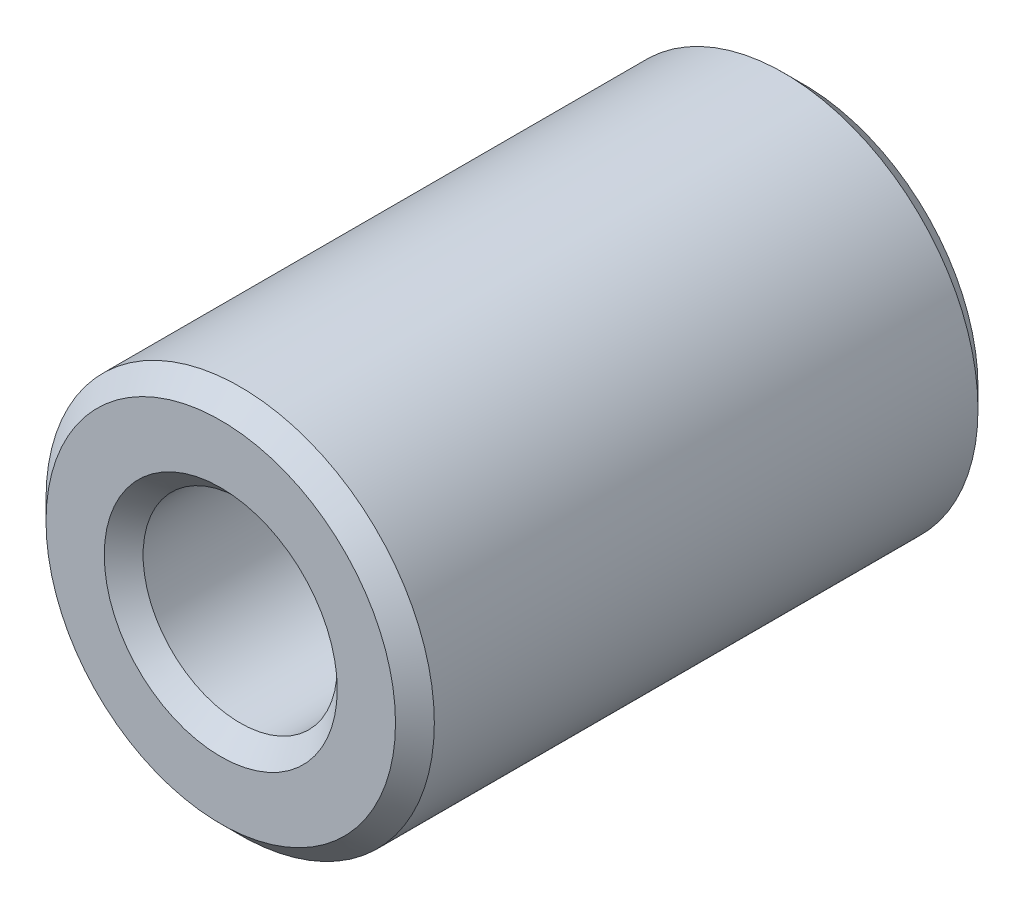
ISO-10303-21;
HEADER;
FILE_DESCRIPTION(('STEP AP214'),'2;1');
FILE_NAME('part.step','',(''),(''),'','','');
FILE_SCHEMA(('AUTOMOTIVE_DESIGN { 1 0 10303 214 1 1 1 1 }'));
ENDSEC;
DATA;
#1=APPLICATION_CONTEXT('core data for automotive mechanical design processes');
#2=APPLICATION_PROTOCOL_DEFINITION('international standard','automotive_design',2000,#1);
#3=PRODUCT_CONTEXT('',#1,'mechanical');
#4=PRODUCT('Part','Part','',(#3));
#5=PRODUCT_RELATED_PRODUCT_CATEGORY('part','',(#4));
#6=PRODUCT_DEFINITION_FORMATION('','',#4);
#7=PRODUCT_DEFINITION_CONTEXT('part definition',#1,'design');
#8=PRODUCT_DEFINITION('design','',#6,#7);
#9=PRODUCT_DEFINITION_SHAPE('','',#8);
#10=(LENGTH_UNIT() NAMED_UNIT(*) SI_UNIT(.MILLI.,.METRE.));
#11=(NAMED_UNIT(*) PLANE_ANGLE_UNIT() SI_UNIT($,.RADIAN.));
#12=(NAMED_UNIT(*) SI_UNIT($,.STERADIAN.) SOLID_ANGLE_UNIT());
#13=UNCERTAINTY_MEASURE_WITH_UNIT(LENGTH_MEASURE(1.E-05),#10,'distance_accuracy_value','');
#14=(GEOMETRIC_REPRESENTATION_CONTEXT(3) GLOBAL_UNCERTAINTY_ASSIGNED_CONTEXT((#13)) GLOBAL_UNIT_ASSIGNED_CONTEXT((#10,
#11,#12)) REPRESENTATION_CONTEXT('',''));
#15=CARTESIAN_POINT('',(0.,0.,0.));
#16=DIRECTION('',(0.,0.,1.));
#17=DIRECTION('',(1.,0.,0.));
#18=AXIS2_PLACEMENT_3D('',#15,#16,#17);
#19=CARTESIAN_POINT('',(0.,0.,-15.));
#20=DIRECTION('',(0.,0.,1.));
#21=DIRECTION('',(1.,0.,0.));
#22=AXIS2_PLACEMENT_3D('',#19,#20,#21);
#23=CYLINDRICAL_SURFACE('',#22,5.);
#24=CARTESIAN_POINT('',(0.,0.,-0.5));
#25=DIRECTION('',(0.,0.,1.));
#26=DIRECTION('',(1.,0.,0.));
#27=AXIS2_PLACEMENT_3D('',#24,#25,#26);
#28=CIRCLE('',#27,5.);
#29=CARTESIAN_POINT('',(5.,0.,-0.5));
#30=VERTEX_POINT('',#29);
#31=EDGE_CURVE('E49',#30,#30,#28,.F.);
#32=ORIENTED_EDGE('',*,*,#31,.T.);
#33=EDGE_LOOP('',(#32));
#34=FACE_BOUND('',#33,.T.);
#35=CARTESIAN_POINT('',(0.,0.,-14.5));
#36=DIRECTION('',(0.,0.,1.));
#37=DIRECTION('',(1.,0.,0.));
#38=AXIS2_PLACEMENT_3D('',#35,#36,#37);
#39=CIRCLE('',#38,5.);
#40=CARTESIAN_POINT('',(5.,0.,-14.5));
#41=VERTEX_POINT('',#40);
#42=EDGE_CURVE('E52',#41,#41,#39,.T.);
#43=ORIENTED_EDGE('',*,*,#42,.T.);
#44=EDGE_LOOP('',(#43));
#45=FACE_BOUND('',#44,.T.);
#46=ADVANCED_FACE('F30',(#34,#45),#23,.T.);
#47=CARTESIAN_POINT('',(0.,0.,-15.));
#48=DIRECTION('',(0.,0.,1.));
#49=DIRECTION('',(1.,0.,0.));
#50=AXIS2_PLACEMENT_3D('',#47,#48,#49);
#51=PLANE('',#50);
#52=CARTESIAN_POINT('',(0.,0.,-15.));
#53=DIRECTION('',(0.,0.,1.));
#54=DIRECTION('',(1.,0.,0.));
#55=AXIS2_PLACEMENT_3D('',#52,#53,#54);
#56=CIRCLE('',#55,4.49999999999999);
#57=CARTESIAN_POINT('',(4.49999999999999,0.,-15.));
#58=VERTEX_POINT('',#57);
#59=EDGE_CURVE('E40',#58,#58,#56,.F.);
#60=ORIENTED_EDGE('',*,*,#59,.T.);
#61=EDGE_LOOP('',(#60));
#62=FACE_BOUND('',#61,.T.);
#63=CARTESIAN_POINT('',(0.,0.,-15.));
#64=DIRECTION('',(0.,0.,1.));
#65=DIRECTION('',(1.,0.,0.));
#66=AXIS2_PLACEMENT_3D('',#63,#64,#65);
#67=CIRCLE('',#66,3.00000000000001);
#68=CARTESIAN_POINT('',(3.00000000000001,0.,-15.));
#69=VERTEX_POINT('',#68);
#70=EDGE_CURVE('E44',#69,#69,#67,.T.);
#71=ORIENTED_EDGE('',*,*,#70,.T.);
#72=EDGE_LOOP('',(#71));
#73=FACE_BOUND('',#72,.T.);
#74=ADVANCED_FACE('F80',(#62,#73),#51,.F.);
#75=CARTESIAN_POINT('',(0.,0.,0.));
#76=DIRECTION('',(0.,0.,1.));
#77=DIRECTION('',(1.,0.,0.));
#78=AXIS2_PLACEMENT_3D('',#75,#76,#77);
#79=PLANE('',#78);
#80=CARTESIAN_POINT('',(0.,0.,0.));
#81=DIRECTION('',(0.,0.,1.));
#82=DIRECTION('',(1.,0.,0.));
#83=AXIS2_PLACEMENT_3D('',#80,#81,#82);
#84=CIRCLE('',#83,4.49999999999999);
#85=CARTESIAN_POINT('',(4.49999999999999,0.,0.));
#86=VERTEX_POINT('',#85);
#87=EDGE_CURVE('E55',#86,#86,#84,.T.);
#88=ORIENTED_EDGE('',*,*,#87,.T.);
#89=EDGE_LOOP('',(#88));
#90=FACE_BOUND('',#89,.T.);
#91=CARTESIAN_POINT('',(0.,0.,0.));
#92=DIRECTION('',(0.,0.,1.));
#93=DIRECTION('',(1.,0.,0.));
#94=AXIS2_PLACEMENT_3D('',#91,#92,#93);
#95=CIRCLE('',#94,3.00000000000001);
#96=CARTESIAN_POINT('',(3.00000000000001,0.,0.));
#97=VERTEX_POINT('',#96);
#98=EDGE_CURVE('E58',#97,#97,#95,.F.);
#99=ORIENTED_EDGE('',*,*,#98,.T.);
#100=EDGE_LOOP('',(#99));
#101=FACE_BOUND('',#100,.T.);
#102=ADVANCED_FACE('F62',(#90,#101),#79,.T.);
#103=CARTESIAN_POINT('',(0.,0.,-15.));
#104=DIRECTION('',(0.,0.,1.));
#105=DIRECTION('',(1.,0.,0.));
#106=AXIS2_PLACEMENT_3D('',#103,#104,#105);
#107=CYLINDRICAL_SURFACE('',#106,2.5);
#108=CARTESIAN_POINT('',(0.,0.,-0.5));
#109=DIRECTION('',(0.,0.,1.));
#110=DIRECTION('',(1.,0.,0.));
#111=AXIS2_PLACEMENT_3D('',#108,#109,#110);
#112=CIRCLE('',#111,2.5);
#113=CARTESIAN_POINT('',(2.5,0.,-0.5));
#114=VERTEX_POINT('',#113);
#115=EDGE_CURVE('E10',#114,#114,#112,.T.);
#116=ORIENTED_EDGE('',*,*,#115,.T.);
#117=EDGE_LOOP('',(#116));
#118=FACE_BOUND('',#117,.T.);
#119=CARTESIAN_POINT('',(0.,0.,-14.5));
#120=DIRECTION('',(0.,0.,1.));
#121=DIRECTION('',(1.,0.,0.));
#122=AXIS2_PLACEMENT_3D('',#119,#120,#121);
#123=CIRCLE('',#122,2.5);
#124=CARTESIAN_POINT('',(2.5,0.,-14.5));
#125=VERTEX_POINT('',#124);
#126=EDGE_CURVE('E36',#125,#125,#123,.F.);
#127=ORIENTED_EDGE('',*,*,#126,.T.);
#128=EDGE_LOOP('',(#127));
#129=FACE_BOUND('',#128,.T.);
#130=ADVANCED_FACE('F93',(#118,#129),#107,.F.);
#131=CARTESIAN_POINT('',(0.,0.,0.));
#132=DIRECTION('',(0.,0.,-1.));
#133=DIRECTION('',(-1.,0.,0.));
#134=AXIS2_PLACEMENT_3D('',#131,#132,#133);
#135=CONICAL_SURFACE('',#134,4.49999999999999,0.785398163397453);
#136=ORIENTED_EDGE('',*,*,#31,.F.);
#137=EDGE_LOOP('',(#136));
#138=FACE_BOUND('',#137,.T.);
#139=ORIENTED_EDGE('',*,*,#87,.F.);
#140=EDGE_LOOP('',(#139));
#141=FACE_BOUND('',#140,.T.);
#142=ADVANCED_FACE('F76',(#138,#141),#135,.T.);
#143=CARTESIAN_POINT('',(0.,0.,-14.5));
#144=DIRECTION('',(0.,0.,1.));
#145=DIRECTION('',(1.,0.,0.));
#146=AXIS2_PLACEMENT_3D('',#143,#144,#145);
#147=CONICAL_SURFACE('',#146,5.,0.785398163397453);
#148=ORIENTED_EDGE('',*,*,#59,.F.);
#149=EDGE_LOOP('',(#148));
#150=FACE_BOUND('',#149,.T.);
#151=ORIENTED_EDGE('',*,*,#42,.F.);
#152=EDGE_LOOP('',(#151));
#153=FACE_BOUND('',#152,.T.);
#154=ADVANCED_FACE('F68',(#150,#153),#147,.T.);
#155=CARTESIAN_POINT('',(0.,0.,-0.5));
#156=DIRECTION('',(0.,0.,1.));
#157=DIRECTION('',(1.,0.,0.));
#158=AXIS2_PLACEMENT_3D('',#155,#156,#157);
#159=CONICAL_SURFACE('',#158,2.5,0.785398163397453);
#160=ORIENTED_EDGE('',*,*,#98,.F.);
#161=EDGE_LOOP('',(#160));
#162=FACE_BOUND('',#161,.T.);
#163=ORIENTED_EDGE('',*,*,#115,.F.);
#164=EDGE_LOOP('',(#163));
#165=FACE_BOUND('',#164,.T.);
#166=ADVANCED_FACE('F64',(#162,#165),#159,.F.);
#167=CARTESIAN_POINT('',(0.,0.,-15.));
#168=DIRECTION('',(0.,0.,-1.));
#169=DIRECTION('',(-1.,0.,0.));
#170=AXIS2_PLACEMENT_3D('',#167,#168,#169);
#171=CONICAL_SURFACE('',#170,3.00000000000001,0.785398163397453);
#172=ORIENTED_EDGE('',*,*,#126,.F.);
#173=EDGE_LOOP('',(#172));
#174=FACE_BOUND('',#173,.T.);
#175=ORIENTED_EDGE('',*,*,#70,.F.);
#176=EDGE_LOOP('',(#175));
#177=FACE_BOUND('',#176,.T.);
#178=ADVANCED_FACE('F67',(#174,#177),#171,.F.);
#179=CLOSED_SHELL('',(#46,#74,#102,#130,#142,#154,#166,#178));
#180=MANIFOLD_SOLID_BREP('B2',#179);
#181=ADVANCED_BREP_SHAPE_REPRESENTATION('',(#18,#180),#14);
#182=SHAPE_DEFINITION_REPRESENTATION(#9,#181);
ENDSEC;
END-ISO-10303-21;
